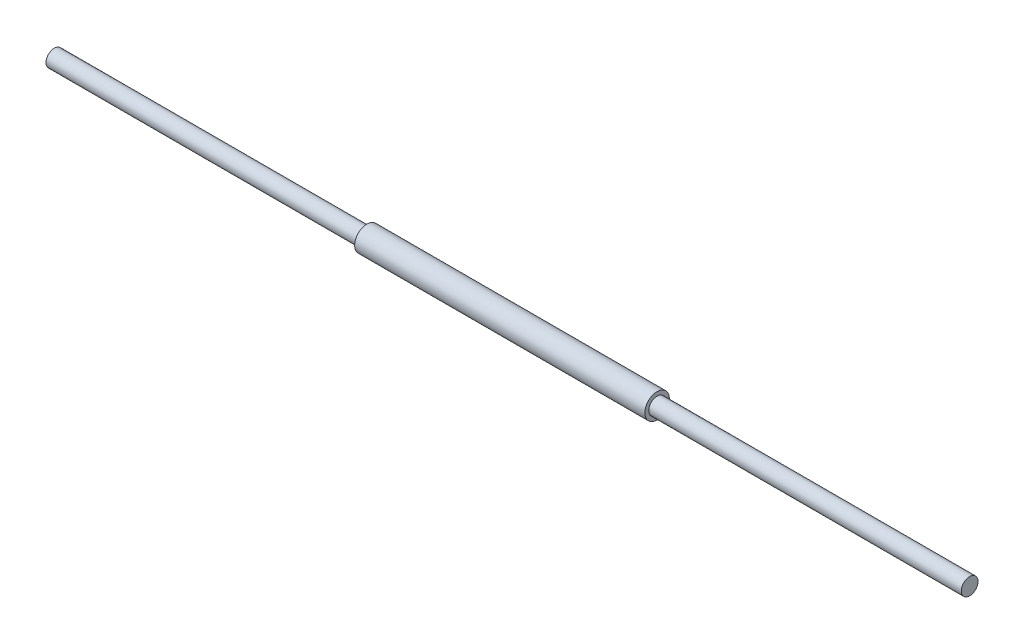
from build123d import *


with BuildPart() as part:
    # Sketch1 → Revolve1 (revolve)
    with BuildSketch(Plane.XY, mode=Mode.PRIVATE) as revolve1_sk:
        Polygon((-260.35, 0), (260.35, 0), (260.35, 4.7625), (82.55, 4.7625), (82.55, 6.985), (-82.55, 6.985), (-82.55, 4.7625), (-260.35, 4.7625), align=None)
    revolve(revolve1_sk.sketch.rotate(Axis((-260.35, 0, 0), (1, 0, 0)), 90), axis=Axis((-260.35, 0, 0), (1, 0, 0)))


solid = part.part
